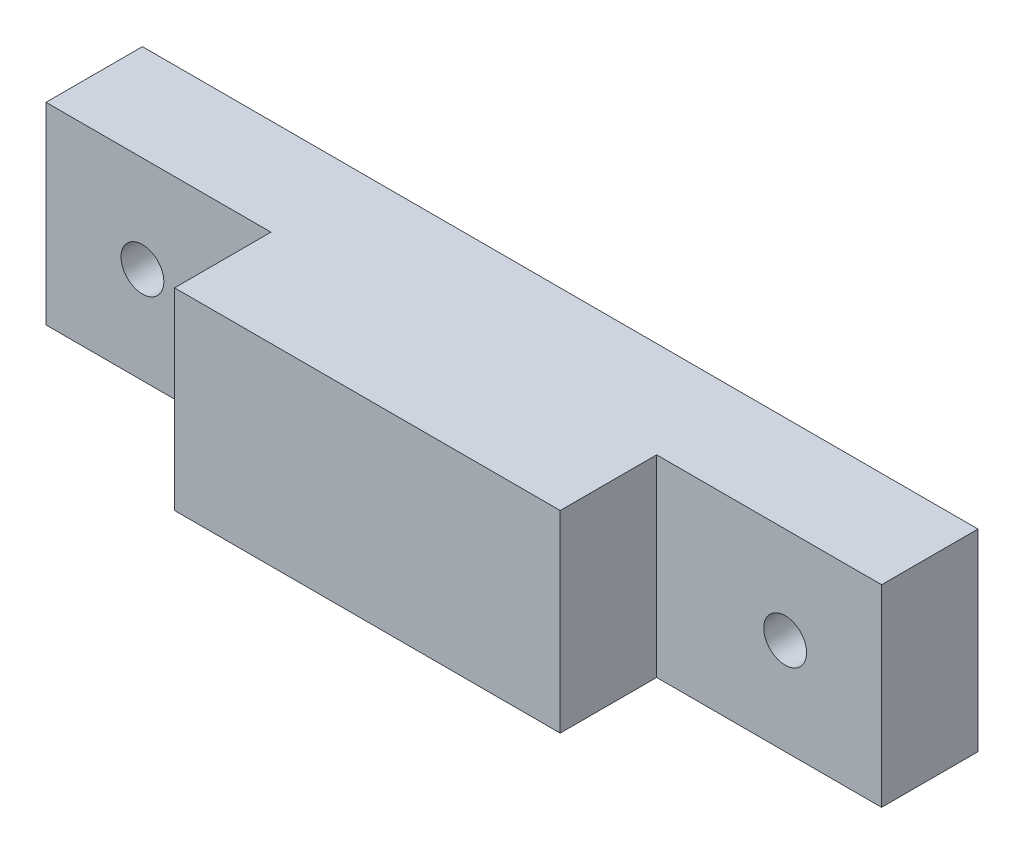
from build123d import *

# Parameters (mm, degrees)
ESQUISSE1_W             = 39
ESQUISSE1_H             = 9
EXTRUSION1_DEPTH        = 9
ESQUISSE2_W             = 10.5
ESQUISSE2_H             = 9
ENL_V_MAT_EXTRU_1_DEPTH = 4.5
ESQUISSE3_R             = 1
ENL_V_MAT_EXTRU_2_DEPTH = 4.5


with BuildPart() as part:
    # Esquisse1 → Extrusion1 (new body)
    with BuildSketch(Plane.XY):
        with Locations((19.5, 4.5)):
            Rectangle(ESQUISSE1_W, ESQUISSE1_H)
    extrude(amount=EXTRUSION1_DEPTH)

    # Esquisse2 → Enl_v. mat.-Extru.1 (cut)
    with BuildSketch(Plane.XY.offset(9)):
        with Locations((5.25, 4.5)):
            Rectangle(ESQUISSE2_W, ESQUISSE2_H)
        with Locations((33.75, 4.5)):
            Rectangle(ESQUISSE2_W, ESQUISSE2_H)
    extrude(amount=-ENL_V_MAT_EXTRU_1_DEPTH, mode=Mode.SUBTRACT)

    # Esquisse3 → Enl_v. mat.-Extru.2 (cut)
    with BuildSketch(Plane.XY.offset(4.5)):
        with Locations((4.5, 4.5)):
            Circle(ESQUISSE3_R)
        with Locations((34.5, 4.5)):
            Circle(ESQUISSE3_R)
    extrude(amount=-ENL_V_MAT_EXTRU_2_DEPTH, mode=Mode.SUBTRACT)


solid = part.part
